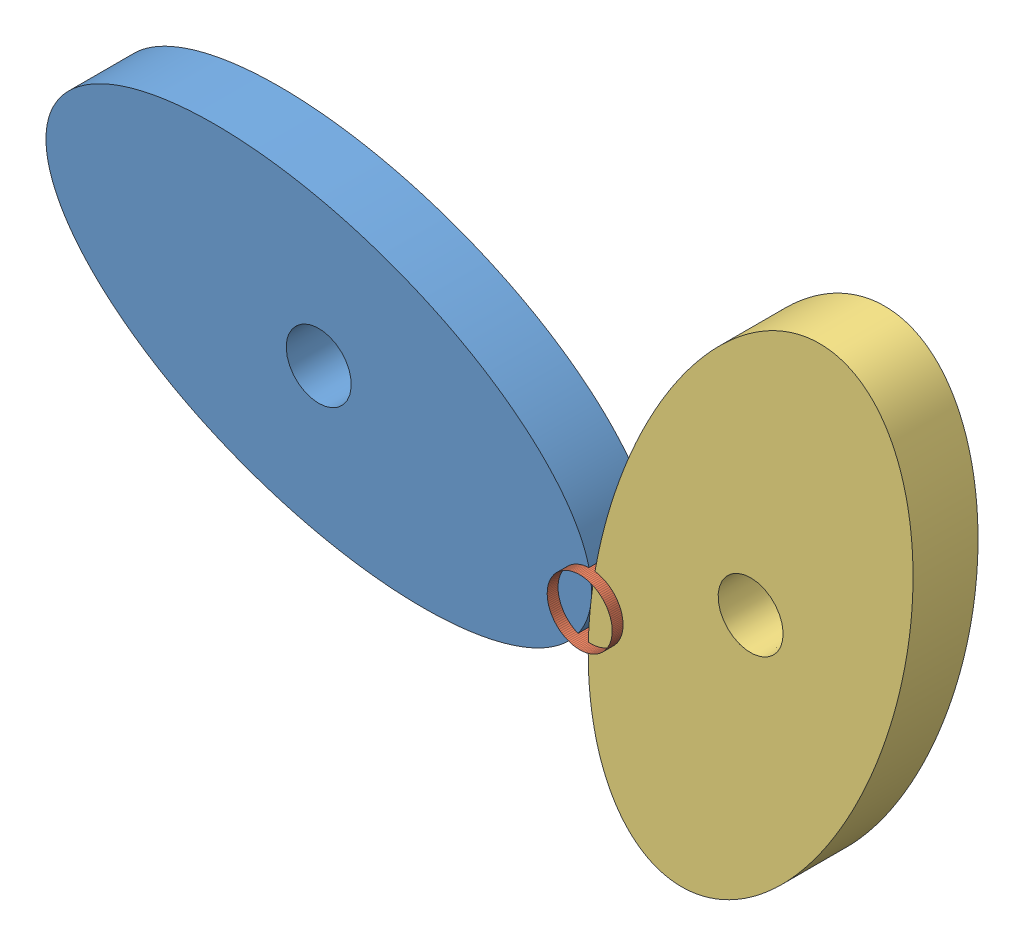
SolidWorks assembly Baugruppe1.SLDASM, configuration Standard (file format 3400). Lengths in mm.
Overall size (223.5 145.16 20).
6 component instances, 3 part files, 6 mates.
Components (placement in the parent):
- ZU BG-1: ZU BG.SLDASM [Standard-_flexible1] x (-0.957844 0.28729 0) z (0 0 1) size (130 73.37 20) (flexible)
  - ZU-1: ZU.SLDPRT [Standard] at origin size (130 65 15)
  - Hilfsglied-1: Hilfsglied.SLDPRT [Standard] at (-64.866 -2.0857 0) x (0.12915 -0.991625 0) z (0 0 1) size (15 15 20)
- ZU BG 1-1: ZU BG 1.SLDASM [Standard-_flexible1] at (99.6839 0 0) x (0.331756 0.943365 0) z (0 0 1) size (130 69.75 20) (flexible)
  - ZU1-1: ZU1.SLDPRT [Standard] at origin size (130 65 15)
  - Hilfsglied-1: Hilfsglied.SLDPRT [Standard] at (-27.9548 29.3408 0) x (0.565593 -0.824685 0) z (0 0 1) size (15 15 20)
Mates (geometry in assembly coordinates):
- Deckungsgleich1: coincident aligned: plane of ?; plane of assembly
- Deckungsgleich2: coincident: axis of ZU BG-1/ZU-1
- Deckungsgleich3: coincident: unknown of ZU BG-1/ZU-1
- Deckungsgleich4: coincident aligned: plane of ?; plane of assembly
- Deckungsgleich5: coincident: unknown of ZU BG 1-1/ZU1-1
- Konzentrisch1: concentric aligned: cylinder of ZU BG-1/Hilfsglied-1; cylinder of ZU BG 1-1/Hilfsglied-1
